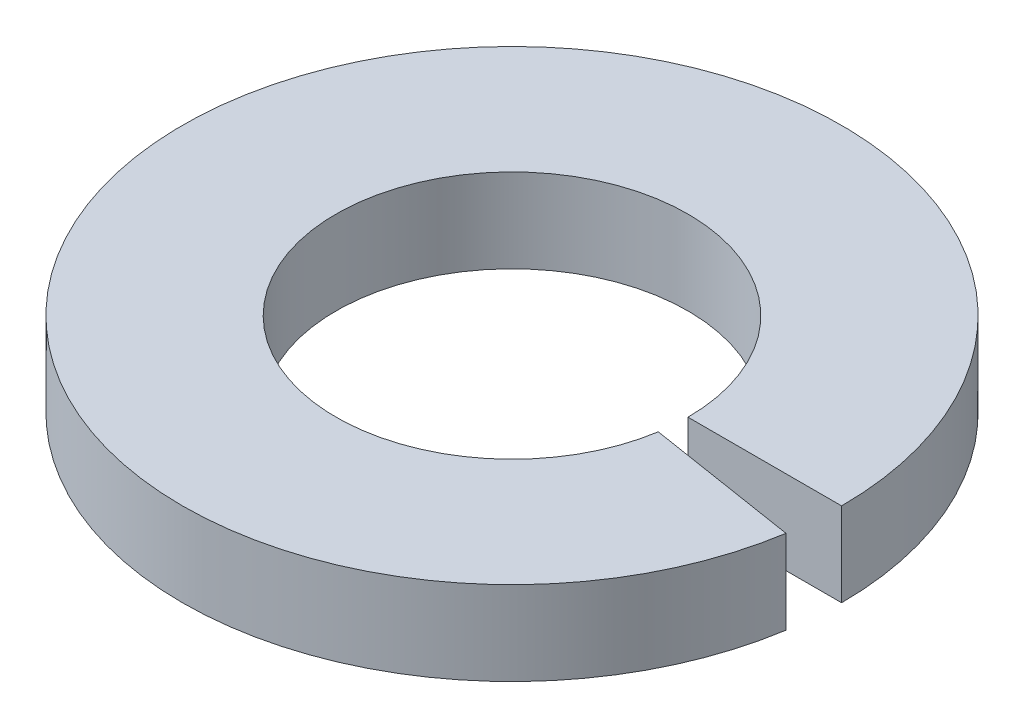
ISO-10303-21;
HEADER;
FILE_DESCRIPTION(('STEP AP214'),'2;1');
FILE_NAME('part.step','',(''),(''),'','','');
FILE_SCHEMA(('AUTOMOTIVE_DESIGN { 1 0 10303 214 1 1 1 1 }'));
ENDSEC;
DATA;
#1=APPLICATION_CONTEXT('core data for automotive mechanical design processes');
#2=APPLICATION_PROTOCOL_DEFINITION('international standard','automotive_design',2000,#1);
#3=PRODUCT_CONTEXT('',#1,'mechanical');
#4=PRODUCT('Part','Part','',(#3));
#5=PRODUCT_RELATED_PRODUCT_CATEGORY('part','',(#4));
#6=PRODUCT_DEFINITION_FORMATION('','',#4);
#7=PRODUCT_DEFINITION_CONTEXT('part definition',#1,'design');
#8=PRODUCT_DEFINITION('design','',#6,#7);
#9=PRODUCT_DEFINITION_SHAPE('','',#8);
#10=(LENGTH_UNIT() NAMED_UNIT(*) SI_UNIT(.MILLI.,.METRE.));
#11=(NAMED_UNIT(*) PLANE_ANGLE_UNIT() SI_UNIT($,.RADIAN.));
#12=(NAMED_UNIT(*) SI_UNIT($,.STERADIAN.) SOLID_ANGLE_UNIT());
#13=UNCERTAINTY_MEASURE_WITH_UNIT(LENGTH_MEASURE(1.E-05),#10,'distance_accuracy_value','');
#14=(GEOMETRIC_REPRESENTATION_CONTEXT(3) GLOBAL_UNCERTAINTY_ASSIGNED_CONTEXT((#13)) GLOBAL_UNIT_ASSIGNED_CONTEXT((#10,
#11,#12)) REPRESENTATION_CONTEXT('',''));
#15=CARTESIAN_POINT('',(0.,0.,0.));
#16=DIRECTION('',(0.,0.,1.));
#17=DIRECTION('',(1.,0.,0.));
#18=AXIS2_PLACEMENT_3D('',#15,#16,#17);
#19=CARTESIAN_POINT('',(6.10875361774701,0.,0.967531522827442));
#20=DIRECTION('',(0.,-1.,0.));
#21=DIRECTION('',(0.,0.,-1.));
#22=AXIS2_PLACEMENT_3D('',#19,#20,#21);
#23=PLANE('',#22);
#24=CARTESIAN_POINT('',(1.52655665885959E-13,0.,0.));
#25=DIRECTION('',(0.,-1.,0.));
#26=DIRECTION('',(0.,0.,-1.));
#27=AXIS2_PLACEMENT_3D('',#24,#25,#26);
#28=CIRCLE('',#27,3.302);
#29=CARTESIAN_POINT('',(3.26134690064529,0.,0.516546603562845));
#30=VERTEX_POINT('',#29);
#31=CARTESIAN_POINT('',(3.30200000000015,0.,0.));
#32=VERTEX_POINT('',#31);
#33=EDGE_CURVE('E11',#30,#32,#28,.T.);
#34=ORIENTED_EDGE('',*,*,#33,.F.);
#35=DIRECTION('',(0.987688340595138,0.,0.156434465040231));
#36=VECTOR('',#35,1.);
#37=CARTESIAN_POINT('',(6.10875361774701,0.,0.967531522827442));
#38=LINE('',#37,#36);
#39=CARTESIAN_POINT('',(6.10875361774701,0.,0.967531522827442));
#40=VERTEX_POINT('',#39);
#41=EDGE_CURVE('E72',#30,#40,#38,.T.);
#42=ORIENTED_EDGE('',*,*,#41,.T.);
#43=CARTESIAN_POINT('',(1.52655665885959E-13,0.,0.));
#44=DIRECTION('',(0.,-1.,0.));
#45=DIRECTION('',(0.,0.,-1.));
#46=AXIS2_PLACEMENT_3D('',#43,#44,#45);
#47=CIRCLE('',#46,6.1849);
#48=CARTESIAN_POINT('',(6.18490000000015,0.,1.11022302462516E-13));
#49=VERTEX_POINT('',#48);
#50=EDGE_CURVE('E67',#40,#49,#47,.T.);
#51=ORIENTED_EDGE('',*,*,#50,.T.);
#52=DIRECTION('',(1.,0.,0.));
#53=VECTOR('',#52,1.);
#54=CARTESIAN_POINT('',(6.18490000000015,0.,1.11022302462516E-13));
#55=LINE('',#54,#53);
#56=EDGE_CURVE('E70',#32,#49,#55,.T.);
#57=ORIENTED_EDGE('',*,*,#56,.F.);
#58=EDGE_LOOP('',(#34,#42,#51,#57));
#59=FACE_BOUND('',#58,.T.);
#60=ADVANCED_FACE('F31',(#59),#23,.T.);
#61=CARTESIAN_POINT('',(1.52655665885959E-13,-78.7400000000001,-1.11022302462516E-13));
#62=DIRECTION('',(0.,-1.,0.));
#63=DIRECTION('',(0.,0.,-1.));
#64=AXIS2_PLACEMENT_3D('',#61,#62,#63);
#65=CYLINDRICAL_SURFACE('',#64,3.302);
#66=CARTESIAN_POINT('',(1.52655665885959E-13,1.57479999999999,0.));
#67=DIRECTION('',(0.,-1.,0.));
#68=DIRECTION('',(0.,0.,-1.));
#69=AXIS2_PLACEMENT_3D('',#66,#67,#68);
#70=CIRCLE('',#69,3.302);
#71=CARTESIAN_POINT('',(3.26134690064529,1.57479999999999,0.516546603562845));
#72=VERTEX_POINT('',#71);
#73=CARTESIAN_POINT('',(3.30200000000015,1.57479999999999,0.));
#74=VERTEX_POINT('',#73);
#75=EDGE_CURVE('E39',#72,#74,#70,.T.);
#76=ORIENTED_EDGE('',*,*,#75,.F.);
#77=DIRECTION('',(0.,-1.,0.));
#78=VECTOR('',#77,1.);
#79=CARTESIAN_POINT('',(3.26134690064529,0.,0.516546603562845));
#80=LINE('',#79,#78);
#81=EDGE_CURVE('E77',#72,#30,#80,.T.);
#82=ORIENTED_EDGE('',*,*,#81,.T.);
#83=ORIENTED_EDGE('',*,*,#33,.T.);
#84=DIRECTION('',(0.,-1.,0.));
#85=VECTOR('',#84,1.);
#86=CARTESIAN_POINT('',(3.30200000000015,0.,0.));
#87=LINE('',#86,#85);
#88=EDGE_CURVE('E89',#74,#32,#87,.T.);
#89=ORIENTED_EDGE('',*,*,#88,.F.);
#90=EDGE_LOOP('',(#76,#82,#83,#89));
#91=FACE_BOUND('',#90,.T.);
#92=ADVANCED_FACE('F33',(#91),#65,.F.);
#93=CARTESIAN_POINT('',(3.26134690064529,1.57479999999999,0.516546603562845));
#94=DIRECTION('',(0.,1.,0.));
#95=DIRECTION('',(0.,0.,1.));
#96=AXIS2_PLACEMENT_3D('',#93,#94,#95);
#97=PLANE('',#96);
#98=CARTESIAN_POINT('',(1.52655665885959E-13,1.57479999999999,0.));
#99=DIRECTION('',(0.,-1.,0.));
#100=DIRECTION('',(0.,0.,-1.));
#101=AXIS2_PLACEMENT_3D('',#98,#99,#100);
#102=CIRCLE('',#101,6.1849);
#103=CARTESIAN_POINT('',(6.10875361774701,1.57480000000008,0.967531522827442));
#104=VERTEX_POINT('',#103);
#105=CARTESIAN_POINT('',(6.18490000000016,1.57479999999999,1.11022302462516E-13));
#106=VERTEX_POINT('',#105);
#107=EDGE_CURVE('E76',#104,#106,#102,.T.);
#108=ORIENTED_EDGE('',*,*,#107,.F.);
#109=DIRECTION('',(-0.987688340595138,0.,-0.156434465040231));
#110=VECTOR('',#109,1.);
#111=CARTESIAN_POINT('',(3.26134690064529,1.57479999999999,0.516546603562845));
#112=LINE('',#111,#110);
#113=EDGE_CURVE('E97',#104,#72,#112,.T.);
#114=ORIENTED_EDGE('',*,*,#113,.T.);
#115=ORIENTED_EDGE('',*,*,#75,.T.);
#116=DIRECTION('',(-1.,0.,0.));
#117=VECTOR('',#116,1.);
#118=CARTESIAN_POINT('',(3.30200000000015,1.57479999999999,0.));
#119=LINE('',#118,#117);
#120=EDGE_CURVE('E85',#106,#74,#119,.T.);
#121=ORIENTED_EDGE('',*,*,#120,.F.);
#122=EDGE_LOOP('',(#108,#114,#115,#121));
#123=FACE_BOUND('',#122,.T.);
#124=ADVANCED_FACE('F101',(#123),#97,.T.);
#125=CARTESIAN_POINT('',(1.52655665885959E-13,-78.7400000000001,-1.11022302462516E-13));
#126=DIRECTION('',(0.,-1.,0.));
#127=DIRECTION('',(0.,0.,-1.));
#128=AXIS2_PLACEMENT_3D('',#125,#126,#127);
#129=CYLINDRICAL_SURFACE('',#128,6.1849);
#130=DIRECTION('',(0.,1.,0.));
#131=VECTOR('',#130,1.);
#132=CARTESIAN_POINT('',(6.10875361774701,1.57480000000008,0.967531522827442));
#133=LINE('',#132,#131);
#134=EDGE_CURVE('E95',#40,#104,#133,.T.);
#135=ORIENTED_EDGE('',*,*,#134,.T.);
#136=ORIENTED_EDGE('',*,*,#107,.T.);
#137=DIRECTION('',(0.,1.,0.));
#138=VECTOR('',#137,1.);
#139=CARTESIAN_POINT('',(6.18490000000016,1.57479999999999,1.11022302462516E-13));
#140=LINE('',#139,#138);
#141=EDGE_CURVE('E80',#49,#106,#140,.T.);
#142=ORIENTED_EDGE('',*,*,#141,.F.);
#143=ORIENTED_EDGE('',*,*,#50,.F.);
#144=EDGE_LOOP('',(#135,#136,#142,#143));
#145=FACE_BOUND('',#144,.T.);
#146=ADVANCED_FACE('F81',(#145),#129,.T.);
#147=CARTESIAN_POINT('',(3.26134690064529,0.,0.516546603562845));
#148=DIRECTION('',(0.156434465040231,0.,-0.987688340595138));
#149=DIRECTION('',(-0.987688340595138,0.,-0.156434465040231));
#150=AXIS2_PLACEMENT_3D('',#147,#148,#149);
#151=PLANE('',#150);
#152=ORIENTED_EDGE('',*,*,#41,.F.);
#153=ORIENTED_EDGE('',*,*,#81,.F.);
#154=ORIENTED_EDGE('',*,*,#113,.F.);
#155=ORIENTED_EDGE('',*,*,#134,.F.);
#156=EDGE_LOOP('',(#152,#153,#154,#155));
#157=FACE_BOUND('',#156,.T.);
#158=ADVANCED_FACE('F105',(#157),#151,.T.);
#159=CARTESIAN_POINT('',(3.30200000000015,0.,0.));
#160=DIRECTION('',(0.,0.,-1.));
#161=DIRECTION('',(-1.,0.,0.));
#162=AXIS2_PLACEMENT_3D('',#159,#160,#161);
#163=PLANE('',#162);
#164=ORIENTED_EDGE('',*,*,#56,.T.);
#165=ORIENTED_EDGE('',*,*,#141,.T.);
#166=ORIENTED_EDGE('',*,*,#120,.T.);
#167=ORIENTED_EDGE('',*,*,#88,.T.);
#168=EDGE_LOOP('',(#164,#165,#166,#167));
#169=FACE_BOUND('',#168,.T.);
#170=ADVANCED_FACE('F88',(#169),#163,.F.);
#171=CLOSED_SHELL('',(#60,#92,#124,#146,#158,#170));
#172=MANIFOLD_SOLID_BREP('B2',#171);
#173=ADVANCED_BREP_SHAPE_REPRESENTATION('',(#18,#172),#14);
#174=SHAPE_DEFINITION_REPRESENTATION(#9,#173);
ENDSEC;
END-ISO-10303-21;
